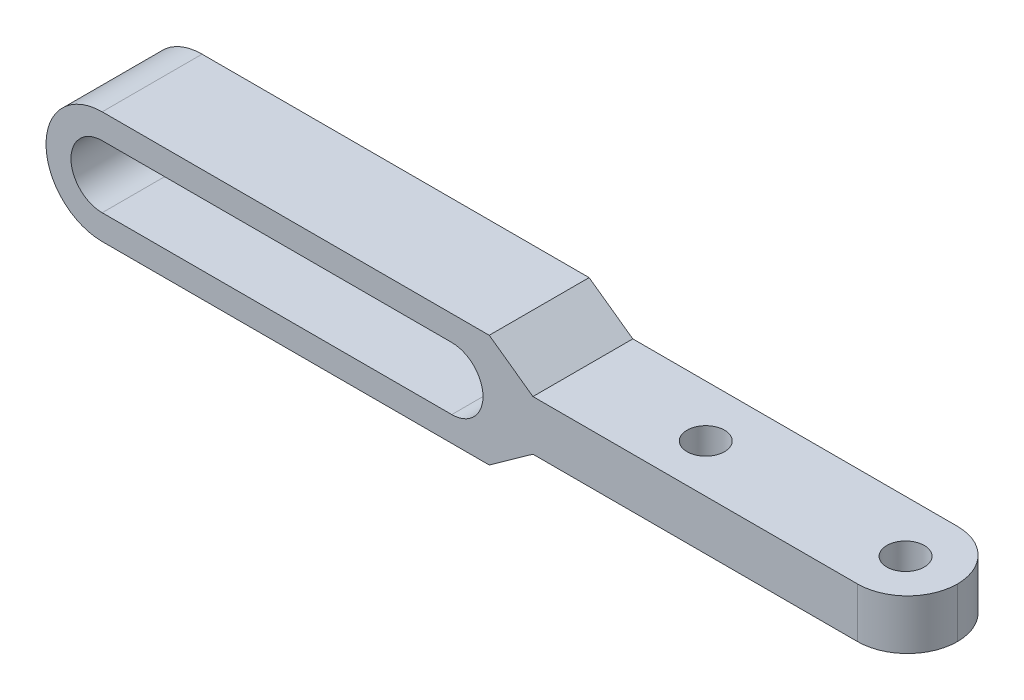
ISO-10303-21;
HEADER;
FILE_DESCRIPTION(('STEP AP214'),'2;1');
FILE_NAME('part.step','',(''),(''),'','','');
FILE_SCHEMA(('AUTOMOTIVE_DESIGN { 1 0 10303 214 1 1 1 1 }'));
ENDSEC;
DATA;
#1=APPLICATION_CONTEXT('core data for automotive mechanical design processes');
#2=APPLICATION_PROTOCOL_DEFINITION('international standard','automotive_design',2000,#1);
#3=PRODUCT_CONTEXT('',#1,'mechanical');
#4=PRODUCT('Part','Part','',(#3));
#5=PRODUCT_RELATED_PRODUCT_CATEGORY('part','',(#4));
#6=PRODUCT_DEFINITION_FORMATION('','',#4);
#7=PRODUCT_DEFINITION_CONTEXT('part definition',#1,'design');
#8=PRODUCT_DEFINITION('design','',#6,#7);
#9=PRODUCT_DEFINITION_SHAPE('','',#8);
#10=(LENGTH_UNIT() NAMED_UNIT(*) SI_UNIT(.MILLI.,.METRE.));
#11=(NAMED_UNIT(*) PLANE_ANGLE_UNIT() SI_UNIT($,.RADIAN.));
#12=(NAMED_UNIT(*) SI_UNIT($,.STERADIAN.) SOLID_ANGLE_UNIT());
#13=UNCERTAINTY_MEASURE_WITH_UNIT(LENGTH_MEASURE(1.E-05),#10,'distance_accuracy_value','');
#14=(GEOMETRIC_REPRESENTATION_CONTEXT(3) GLOBAL_UNCERTAINTY_ASSIGNED_CONTEXT((#13)) GLOBAL_UNIT_ASSIGNED_CONTEXT((#10,
#11,#12)) REPRESENTATION_CONTEXT('',''));
#15=CARTESIAN_POINT('',(0.,0.,0.));
#16=DIRECTION('',(0.,0.,1.));
#17=DIRECTION('',(1.,0.,0.));
#18=AXIS2_PLACEMENT_3D('',#15,#16,#17);
#19=CARTESIAN_POINT('',(0.,0.,16.));
#20=DIRECTION('',(-0.581238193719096,-0.813733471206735,0.));
#21=DIRECTION('',(0.813733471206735,-0.581238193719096,0.));
#22=AXIS2_PLACEMENT_3D('',#19,#20,#21);
#23=PLANE('',#22);
#24=DIRECTION('',(-0.813733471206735,0.581238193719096,0.));
#25=VECTOR('',#24,1.);
#26=CARTESIAN_POINT('',(0.,0.,0.));
#27=LINE('',#26,#25);
#28=CARTESIAN_POINT('',(0.,0.,0.));
#29=VERTEX_POINT('',#28);
#30=CARTESIAN_POINT('',(-7.,5.,0.));
#31=VERTEX_POINT('',#30);
#32=EDGE_CURVE('E201',#29,#31,#27,.T.);
#33=ORIENTED_EDGE('',*,*,#32,.T.);
#34=DIRECTION('',(0.,0.,-1.));
#35=VECTOR('',#34,1.);
#36=CARTESIAN_POINT('',(-7.,5.,16.));
#37=LINE('',#36,#35);
#38=CARTESIAN_POINT('',(-7.,5.,16.));
#39=VERTEX_POINT('',#38);
#40=EDGE_CURVE('E222',#39,#31,#37,.T.);
#41=ORIENTED_EDGE('',*,*,#40,.F.);
#42=DIRECTION('',(-0.813733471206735,0.581238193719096,0.));
#43=VECTOR('',#42,1.);
#44=CARTESIAN_POINT('',(0.,0.,16.));
#45=LINE('',#44,#43);
#46=CARTESIAN_POINT('',(0.,0.,16.));
#47=VERTEX_POINT('',#46);
#48=EDGE_CURVE('E184',#47,#39,#45,.T.);
#49=ORIENTED_EDGE('',*,*,#48,.F.);
#50=DIRECTION('',(0.,0.,-1.));
#51=VECTOR('',#50,1.);
#52=CARTESIAN_POINT('',(0.,0.,16.));
#53=LINE('',#52,#51);
#54=EDGE_CURVE('E200',#47,#29,#53,.T.);
#55=ORIENTED_EDGE('',*,*,#54,.T.);
#56=EDGE_LOOP('',(#33,#41,#49,#55));
#57=FACE_BOUND('',#56,.T.);
#58=ADVANCED_FACE('F33',(#57),#23,.F.);
#59=CARTESIAN_POINT('',(-7.,5.,16.));
#60=DIRECTION('',(0.,-1.,0.));
#61=DIRECTION('',(1.,0.,0.));
#62=AXIS2_PLACEMENT_3D('',#59,#60,#61);
#63=PLANE('',#62);
#64=DIRECTION('',(-1.,0.,0.));
#65=VECTOR('',#64,1.);
#66=CARTESIAN_POINT('',(-7.,5.,0.));
#67=LINE('',#66,#65);
#68=CARTESIAN_POINT('',(-69.,4.99999999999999,0.));
#69=VERTEX_POINT('',#68);
#70=EDGE_CURVE('E204',#31,#69,#67,.T.);
#71=ORIENTED_EDGE('',*,*,#70,.T.);
#72=DIRECTION('',(0.,0.,-1.));
#73=VECTOR('',#72,1.);
#74=CARTESIAN_POINT('',(-69.,4.99999999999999,16.));
#75=LINE('',#74,#73);
#76=CARTESIAN_POINT('',(-69.,4.99999999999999,16.));
#77=VERTEX_POINT('',#76);
#78=EDGE_CURVE('E11',#69,#77,#75,.F.);
#79=ORIENTED_EDGE('',*,*,#78,.T.);
#80=DIRECTION('',(-1.,0.,0.));
#81=VECTOR('',#80,1.);
#82=CARTESIAN_POINT('',(-7.,5.,16.));
#83=LINE('',#82,#81);
#84=EDGE_CURVE('E187',#39,#77,#83,.T.);
#85=ORIENTED_EDGE('',*,*,#84,.F.);
#86=ORIENTED_EDGE('',*,*,#40,.T.);
#87=EDGE_LOOP('',(#71,#79,#85,#86));
#88=FACE_BOUND('',#87,.T.);
#89=ADVANCED_FACE('F278',(#88),#63,.F.);
#90=CARTESIAN_POINT('',(-78.,-13.,16.));
#91=DIRECTION('',(0.,1.,0.));
#92=DIRECTION('',(-1.,0.,0.));
#93=AXIS2_PLACEMENT_3D('',#90,#91,#92);
#94=PLANE('',#93);
#95=DIRECTION('',(1.,0.,0.));
#96=VECTOR('',#95,1.);
#97=CARTESIAN_POINT('',(-78.,-13.,16.));
#98=LINE('',#97,#96);
#99=CARTESIAN_POINT('',(-69.,-13.,16.));
#100=VERTEX_POINT('',#99);
#101=CARTESIAN_POINT('',(-7.00000000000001,-13.,16.));
#102=VERTEX_POINT('',#101);
#103=EDGE_CURVE('E190',#100,#102,#98,.T.);
#104=ORIENTED_EDGE('',*,*,#103,.F.);
#105=DIRECTION('',(0.,0.,-1.));
#106=VECTOR('',#105,1.);
#107=CARTESIAN_POINT('',(-69.,-13.,16.));
#108=LINE('',#107,#106);
#109=CARTESIAN_POINT('',(-69.,-13.,0.));
#110=VERTEX_POINT('',#109);
#111=EDGE_CURVE('E242',#100,#110,#108,.T.);
#112=ORIENTED_EDGE('',*,*,#111,.T.);
#113=DIRECTION('',(1.,0.,0.));
#114=VECTOR('',#113,1.);
#115=CARTESIAN_POINT('',(-78.,-13.,0.));
#116=LINE('',#115,#114);
#117=CARTESIAN_POINT('',(-7.00000000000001,-13.,0.));
#118=VERTEX_POINT('',#117);
#119=EDGE_CURVE('E206',#110,#118,#116,.T.);
#120=ORIENTED_EDGE('',*,*,#119,.T.);
#121=DIRECTION('',(0.,0.,-1.));
#122=VECTOR('',#121,1.);
#123=CARTESIAN_POINT('',(-7.00000000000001,-13.,16.));
#124=LINE('',#123,#122);
#125=EDGE_CURVE('E219',#102,#118,#124,.T.);
#126=ORIENTED_EDGE('',*,*,#125,.F.);
#127=EDGE_LOOP('',(#104,#112,#120,#126));
#128=FACE_BOUND('',#127,.T.);
#129=ADVANCED_FACE('F259',(#128),#94,.F.);
#130=CARTESIAN_POINT('',(-7.00000000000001,-13.,16.));
#131=DIRECTION('',(-0.581238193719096,0.813733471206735,0.));
#132=DIRECTION('',(-0.813733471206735,-0.581238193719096,0.));
#133=AXIS2_PLACEMENT_3D('',#130,#131,#132);
#134=PLANE('',#133);
#135=DIRECTION('',(0.813733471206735,0.581238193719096,0.));
#136=VECTOR('',#135,1.);
#137=CARTESIAN_POINT('',(-7.00000000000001,-13.,0.));
#138=LINE('',#137,#136);
#139=CARTESIAN_POINT('',(0.,-7.99999999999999,0.));
#140=VERTEX_POINT('',#139);
#141=EDGE_CURVE('E208',#118,#140,#138,.T.);
#142=ORIENTED_EDGE('',*,*,#141,.T.);
#143=DIRECTION('',(0.,0.,-1.));
#144=VECTOR('',#143,1.);
#145=CARTESIAN_POINT('',(0.,-7.99999999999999,16.));
#146=LINE('',#145,#144);
#147=CARTESIAN_POINT('',(0.,-7.99999999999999,16.));
#148=VERTEX_POINT('',#147);
#149=EDGE_CURVE('E216',#148,#140,#146,.T.);
#150=ORIENTED_EDGE('',*,*,#149,.F.);
#151=DIRECTION('',(0.813733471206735,0.581238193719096,0.));
#152=VECTOR('',#151,1.);
#153=CARTESIAN_POINT('',(-7.00000000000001,-13.,16.));
#154=LINE('',#153,#152);
#155=EDGE_CURVE('E192',#102,#148,#154,.T.);
#156=ORIENTED_EDGE('',*,*,#155,.F.);
#157=ORIENTED_EDGE('',*,*,#125,.T.);
#158=EDGE_LOOP('',(#142,#150,#156,#157));
#159=FACE_BOUND('',#158,.T.);
#160=ADVANCED_FACE('F313',(#159),#134,.F.);
#161=CARTESIAN_POINT('',(60.,-7.99999999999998,16.));
#162=DIRECTION('',(0.,-1.,0.));
#163=DIRECTION('',(1.,0.,0.));
#164=AXIS2_PLACEMENT_3D('',#161,#162,#163);
#165=PLANE('',#164);
#166=CARTESIAN_POINT('',(52.,-7.99999999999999,8.31174647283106));
#167=DIRECTION('',(0.,-1.,0.));
#168=DIRECTION('',(0.,0.,-1.));
#169=AXIS2_PLACEMENT_3D('',#166,#167,#168);
#170=CIRCLE('',#169,3.);
#171=CARTESIAN_POINT('',(52.,-7.99999999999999,5.31174647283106));
#172=VERTEX_POINT('',#171);
#173=EDGE_CURVE('E173',#172,#172,#170,.T.);
#174=ORIENTED_EDGE('',*,*,#173,.F.);
#175=EDGE_LOOP('',(#174));
#176=FACE_BOUND('',#175,.T.);
#177=CARTESIAN_POINT('',(20.,-7.99999999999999,8.31174647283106));
#178=DIRECTION('',(0.,-1.,0.));
#179=DIRECTION('',(0.,0.,-1.));
#180=AXIS2_PLACEMENT_3D('',#177,#178,#179);
#181=CIRCLE('',#180,3.);
#182=CARTESIAN_POINT('',(20.,-7.99999999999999,5.31174647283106));
#183=VERTEX_POINT('',#182);
#184=EDGE_CURVE('E180',#183,#183,#181,.T.);
#185=ORIENTED_EDGE('',*,*,#184,.F.);
#186=EDGE_LOOP('',(#185));
#187=FACE_BOUND('',#186,.T.);
#188=DIRECTION('',(-1.,0.,0.));
#189=VECTOR('',#188,1.);
#190=CARTESIAN_POINT('',(60.,-7.99999999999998,0.));
#191=LINE('',#190,#189);
#192=CARTESIAN_POINT('',(52.,-7.99999999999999,0.));
#193=VERTEX_POINT('',#192);
#194=EDGE_CURVE('E211',#193,#140,#191,.T.);
#195=ORIENTED_EDGE('',*,*,#194,.F.);
#196=CARTESIAN_POINT('',(52.,-7.99999999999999,8.));
#197=DIRECTION('',(0.,-1.,0.));
#198=DIRECTION('',(1.,0.,0.));
#199=AXIS2_PLACEMENT_3D('',#196,#197,#198);
#200=CIRCLE('',#199,8.);
#201=CARTESIAN_POINT('',(60.,-7.99999999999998,8.));
#202=VERTEX_POINT('',#201);
#203=EDGE_CURVE('E234',#193,#202,#200,.T.);
#204=ORIENTED_EDGE('',*,*,#203,.T.);
#205=CARTESIAN_POINT('',(52.,-7.99999999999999,8.));
#206=DIRECTION('',(0.,-1.,0.));
#207=DIRECTION('',(1.,0.,0.));
#208=AXIS2_PLACEMENT_3D('',#205,#206,#207);
#209=CIRCLE('',#208,8.);
#210=CARTESIAN_POINT('',(52.,-7.99999999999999,16.));
#211=VERTEX_POINT('',#210);
#212=EDGE_CURVE('E232',#202,#211,#209,.T.);
#213=ORIENTED_EDGE('',*,*,#212,.T.);
#214=DIRECTION('',(-1.,0.,0.));
#215=VECTOR('',#214,1.);
#216=CARTESIAN_POINT('',(60.,-7.99999999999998,16.));
#217=LINE('',#216,#215);
#218=EDGE_CURVE('E195',#211,#148,#217,.T.);
#219=ORIENTED_EDGE('',*,*,#218,.T.);
#220=ORIENTED_EDGE('',*,*,#149,.T.);
#221=EDGE_LOOP('',(#195,#204,#213,#219,#220));
#222=FACE_BOUND('',#221,.T.);
#223=ADVANCED_FACE('F311',(#176,#187,#222),#165,.T.);
#224=CARTESIAN_POINT('',(0.,0.,16.));
#225=DIRECTION('',(0.,1.,0.));
#226=DIRECTION('',(-1.,0.,0.));
#227=AXIS2_PLACEMENT_3D('',#224,#225,#226);
#228=PLANE('',#227);
#229=CARTESIAN_POINT('',(52.,0.,8.31174647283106));
#230=DIRECTION('',(0.,1.,0.));
#231=DIRECTION('',(-1.,0.,0.));
#232=AXIS2_PLACEMENT_3D('',#229,#230,#231);
#233=CIRCLE('',#232,3.);
#234=CARTESIAN_POINT('',(49.,0.,8.31174647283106));
#235=VERTEX_POINT('',#234);
#236=EDGE_CURVE('E179',#235,#235,#233,.T.);
#237=ORIENTED_EDGE('',*,*,#236,.F.);
#238=EDGE_LOOP('',(#237));
#239=FACE_BOUND('',#238,.T.);
#240=CARTESIAN_POINT('',(20.,0.,8.31174647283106));
#241=DIRECTION('',(0.,1.,0.));
#242=DIRECTION('',(-1.,0.,0.));
#243=AXIS2_PLACEMENT_3D('',#240,#241,#242);
#244=CIRCLE('',#243,3.);
#245=CARTESIAN_POINT('',(17.,0.,8.31174647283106));
#246=VERTEX_POINT('',#245);
#247=EDGE_CURVE('E183',#246,#246,#244,.T.);
#248=ORIENTED_EDGE('',*,*,#247,.F.);
#249=EDGE_LOOP('',(#248));
#250=FACE_BOUND('',#249,.T.);
#251=CARTESIAN_POINT('',(52.,0.,8.));
#252=DIRECTION('',(0.,1.,0.));
#253=DIRECTION('',(-1.,0.,0.));
#254=AXIS2_PLACEMENT_3D('',#251,#252,#253);
#255=CIRCLE('',#254,8.);
#256=CARTESIAN_POINT('',(52.,0.,16.));
#257=VERTEX_POINT('',#256);
#258=CARTESIAN_POINT('',(60.,0.,8.));
#259=VERTEX_POINT('',#258);
#260=EDGE_CURVE('E236',#257,#259,#255,.T.);
#261=ORIENTED_EDGE('',*,*,#260,.T.);
#262=CARTESIAN_POINT('',(52.,0.,8.));
#263=DIRECTION('',(0.,1.,0.));
#264=DIRECTION('',(-1.,0.,0.));
#265=AXIS2_PLACEMENT_3D('',#262,#263,#264);
#266=CIRCLE('',#265,8.);
#267=CARTESIAN_POINT('',(52.,0.,0.));
#268=VERTEX_POINT('',#267);
#269=EDGE_CURVE('E238',#259,#268,#266,.T.);
#270=ORIENTED_EDGE('',*,*,#269,.T.);
#271=DIRECTION('',(1.,0.,0.));
#272=VECTOR('',#271,1.);
#273=CARTESIAN_POINT('',(0.,0.,0.));
#274=LINE('',#273,#272);
#275=EDGE_CURVE('E188',#29,#268,#274,.T.);
#276=ORIENTED_EDGE('',*,*,#275,.F.);
#277=ORIENTED_EDGE('',*,*,#54,.F.);
#278=DIRECTION('',(1.,0.,0.));
#279=VECTOR('',#278,1.);
#280=CARTESIAN_POINT('',(0.,0.,16.));
#281=LINE('',#280,#279);
#282=EDGE_CURVE('E197',#47,#257,#281,.T.);
#283=ORIENTED_EDGE('',*,*,#282,.T.);
#284=EDGE_LOOP('',(#261,#270,#276,#277,#283));
#285=FACE_BOUND('',#284,.T.);
#286=ADVANCED_FACE('F302',(#239,#250,#285),#228,.T.);
#287=CARTESIAN_POINT('',(0.,0.,16.));
#288=DIRECTION('',(0.,0.,-1.));
#289=DIRECTION('',(-1.,0.,0.));
#290=AXIS2_PLACEMENT_3D('',#287,#288,#289);
#291=PLANE('',#290);
#292=DIRECTION('',(1.,0.,0.));
#293=VECTOR('',#292,1.);
#294=CARTESIAN_POINT('',(-69.,-9.00000000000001,16.));
#295=LINE('',#294,#293);
#296=CARTESIAN_POINT('',(-69.,-9.00000000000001,16.));
#297=VERTEX_POINT('',#296);
#298=CARTESIAN_POINT('',(-13.,-9.,16.));
#299=VERTEX_POINT('',#298);
#300=EDGE_CURVE('E146',#297,#299,#295,.T.);
#301=ORIENTED_EDGE('',*,*,#300,.F.);
#302=CARTESIAN_POINT('',(-69.,-4.,16.));
#303=DIRECTION('',(0.,0.,-1.));
#304=DIRECTION('',(-1.,0.,0.));
#305=AXIS2_PLACEMENT_3D('',#302,#303,#304);
#306=CIRCLE('',#305,5.);
#307=CARTESIAN_POINT('',(-69.,0.999999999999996,16.));
#308=VERTEX_POINT('',#307);
#309=EDGE_CURVE('E138',#297,#308,#306,.T.);
#310=ORIENTED_EDGE('',*,*,#309,.T.);
#311=DIRECTION('',(1.,0.,0.));
#312=VECTOR('',#311,1.);
#313=CARTESIAN_POINT('',(-69.,0.999999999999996,16.));
#314=LINE('',#313,#312);
#315=CARTESIAN_POINT('',(-13.,0.999999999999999,16.));
#316=VERTEX_POINT('',#315);
#317=EDGE_CURVE('E150',#308,#316,#314,.T.);
#318=ORIENTED_EDGE('',*,*,#317,.T.);
#319=CARTESIAN_POINT('',(-13.,-4.,16.));
#320=DIRECTION('',(0.,0.,-1.));
#321=DIRECTION('',(-1.,0.,0.));
#322=AXIS2_PLACEMENT_3D('',#319,#320,#321);
#323=CIRCLE('',#322,5.);
#324=EDGE_CURVE('E154',#316,#299,#323,.T.);
#325=ORIENTED_EDGE('',*,*,#324,.T.);
#326=EDGE_LOOP('',(#301,#310,#318,#325));
#327=FACE_BOUND('',#326,.T.);
#328=CARTESIAN_POINT('',(-69.,-4.00000000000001,16.));
#329=DIRECTION('',(0.,0.,-1.));
#330=DIRECTION('',(-1.,0.,0.));
#331=AXIS2_PLACEMENT_3D('',#328,#329,#330);
#332=CIRCLE('',#331,9.);
#333=CARTESIAN_POINT('',(-78.,-4.00000000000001,16.));
#334=VERTEX_POINT('',#333);
#335=EDGE_CURVE('E49',#77,#334,#332,.F.);
#336=ORIENTED_EDGE('',*,*,#335,.T.);
#337=CARTESIAN_POINT('',(-69.,-4.00000000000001,16.));
#338=DIRECTION('',(0.,0.,-1.));
#339=DIRECTION('',(-1.,0.,0.));
#340=AXIS2_PLACEMENT_3D('',#337,#338,#339);
#341=CIRCLE('',#340,9.);
#342=EDGE_CURVE('E42',#334,#100,#341,.F.);
#343=ORIENTED_EDGE('',*,*,#342,.T.);
#344=ORIENTED_EDGE('',*,*,#103,.T.);
#345=ORIENTED_EDGE('',*,*,#155,.T.);
#346=ORIENTED_EDGE('',*,*,#218,.F.);
#347=DIRECTION('',(0.,-1.,0.));
#348=VECTOR('',#347,1.);
#349=CARTESIAN_POINT('',(52.,0.,16.));
#350=LINE('',#349,#348);
#351=EDGE_CURVE('E240',#211,#257,#350,.F.);
#352=ORIENTED_EDGE('',*,*,#351,.T.);
#353=ORIENTED_EDGE('',*,*,#282,.F.);
#354=ORIENTED_EDGE('',*,*,#48,.T.);
#355=ORIENTED_EDGE('',*,*,#84,.T.);
#356=EDGE_LOOP('',(#336,#343,#344,#345,#346,#352,#353,#354,#355));
#357=FACE_BOUND('',#356,.T.);
#358=ADVANCED_FACE('F156',(#327,#357),#291,.F.);
#359=CARTESIAN_POINT('',(0.,0.,0.));
#360=DIRECTION('',(0.,0.,-1.));
#361=DIRECTION('',(-1.,0.,0.));
#362=AXIS2_PLACEMENT_3D('',#359,#360,#361);
#363=PLANE('',#362);
#364=CARTESIAN_POINT('',(-69.,-4.,0.));
#365=DIRECTION('',(0.,0.,-1.));
#366=DIRECTION('',(-1.,0.,0.));
#367=AXIS2_PLACEMENT_3D('',#364,#365,#366);
#368=CIRCLE('',#367,5.);
#369=CARTESIAN_POINT('',(-69.,-9.00000000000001,0.));
#370=VERTEX_POINT('',#369);
#371=CARTESIAN_POINT('',(-69.,0.999999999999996,0.));
#372=VERTEX_POINT('',#371);
#373=EDGE_CURVE('E141',#370,#372,#368,.T.);
#374=ORIENTED_EDGE('',*,*,#373,.F.);
#375=DIRECTION('',(1.,0.,0.));
#376=VECTOR('',#375,1.);
#377=CARTESIAN_POINT('',(-69.,-9.00000000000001,0.));
#378=LINE('',#377,#376);
#379=CARTESIAN_POINT('',(-13.,-9.,0.));
#380=VERTEX_POINT('',#379);
#381=EDGE_CURVE('E157',#370,#380,#378,.T.);
#382=ORIENTED_EDGE('',*,*,#381,.T.);
#383=CARTESIAN_POINT('',(-13.,-4.,0.));
#384=DIRECTION('',(0.,0.,-1.));
#385=DIRECTION('',(-1.,0.,0.));
#386=AXIS2_PLACEMENT_3D('',#383,#384,#385);
#387=CIRCLE('',#386,5.);
#388=CARTESIAN_POINT('',(-13.,0.999999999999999,0.));
#389=VERTEX_POINT('',#388);
#390=EDGE_CURVE('E160',#389,#380,#387,.T.);
#391=ORIENTED_EDGE('',*,*,#390,.F.);
#392=DIRECTION('',(1.,0.,0.));
#393=VECTOR('',#392,1.);
#394=CARTESIAN_POINT('',(-69.,0.999999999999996,0.));
#395=LINE('',#394,#393);
#396=EDGE_CURVE('E166',#372,#389,#395,.T.);
#397=ORIENTED_EDGE('',*,*,#396,.F.);
#398=EDGE_LOOP('',(#374,#382,#391,#397));
#399=FACE_BOUND('',#398,.T.);
#400=ORIENTED_EDGE('',*,*,#119,.F.);
#401=CARTESIAN_POINT('',(-69.,-4.00000000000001,0.));
#402=DIRECTION('',(0.,0.,-1.));
#403=DIRECTION('',(-1.,0.,0.));
#404=AXIS2_PLACEMENT_3D('',#401,#402,#403);
#405=CIRCLE('',#404,9.);
#406=CARTESIAN_POINT('',(-78.,-4.00000000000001,0.));
#407=VERTEX_POINT('',#406);
#408=EDGE_CURVE('E249',#110,#407,#405,.T.);
#409=ORIENTED_EDGE('',*,*,#408,.T.);
#410=CARTESIAN_POINT('',(-69.,-4.00000000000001,0.));
#411=DIRECTION('',(0.,0.,-1.));
#412=DIRECTION('',(-1.,0.,0.));
#413=AXIS2_PLACEMENT_3D('',#410,#411,#412);
#414=CIRCLE('',#413,9.);
#415=EDGE_CURVE('E247',#407,#69,#414,.T.);
#416=ORIENTED_EDGE('',*,*,#415,.T.);
#417=ORIENTED_EDGE('',*,*,#70,.F.);
#418=ORIENTED_EDGE('',*,*,#32,.F.);
#419=ORIENTED_EDGE('',*,*,#275,.T.);
#420=DIRECTION('',(0.,-1.,0.));
#421=VECTOR('',#420,1.);
#422=CARTESIAN_POINT('',(52.,0.,0.));
#423=LINE('',#422,#421);
#424=EDGE_CURVE('E225',#268,#193,#423,.T.);
#425=ORIENTED_EDGE('',*,*,#424,.T.);
#426=ORIENTED_EDGE('',*,*,#194,.T.);
#427=ORIENTED_EDGE('',*,*,#141,.F.);
#428=EDGE_LOOP('',(#400,#409,#416,#417,#418,#419,#425,#426,#427));
#429=FACE_BOUND('',#428,.T.);
#430=ADVANCED_FACE('F265',(#399,#429),#363,.T.);
#431=CARTESIAN_POINT('',(20.,8.00000000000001,8.31174647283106));
#432=DIRECTION('',(0.,-1.,0.));
#433=DIRECTION('',(0.,0.,-1.));
#434=AXIS2_PLACEMENT_3D('',#431,#432,#433);
#435=CYLINDRICAL_SURFACE('',#434,3.);
#436=ORIENTED_EDGE('',*,*,#247,.T.);
#437=EDGE_LOOP('',(#436));
#438=FACE_BOUND('',#437,.T.);
#439=ORIENTED_EDGE('',*,*,#184,.T.);
#440=EDGE_LOOP('',(#439));
#441=FACE_BOUND('',#440,.T.);
#442=ADVANCED_FACE('F328',(#438,#441),#435,.F.);
#443=CARTESIAN_POINT('',(52.,8.00000000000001,8.31174647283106));
#444=DIRECTION('',(0.,-1.,0.));
#445=DIRECTION('',(0.,0.,-1.));
#446=AXIS2_PLACEMENT_3D('',#443,#444,#445);
#447=CYLINDRICAL_SURFACE('',#446,3.);
#448=ORIENTED_EDGE('',*,*,#236,.T.);
#449=EDGE_LOOP('',(#448));
#450=FACE_BOUND('',#449,.T.);
#451=ORIENTED_EDGE('',*,*,#173,.T.);
#452=EDGE_LOOP('',(#451));
#453=FACE_BOUND('',#452,.T.);
#454=ADVANCED_FACE('F334',(#450,#453),#447,.F.);
#455=CARTESIAN_POINT('',(-69.,-4.,16.));
#456=DIRECTION('',(0.,0.,-1.));
#457=DIRECTION('',(-1.,0.,0.));
#458=AXIS2_PLACEMENT_3D('',#455,#456,#457);
#459=CYLINDRICAL_SURFACE('',#458,5.);
#460=ORIENTED_EDGE('',*,*,#373,.T.);
#461=DIRECTION('',(0.,0.,-1.));
#462=VECTOR('',#461,1.);
#463=CARTESIAN_POINT('',(-69.,0.999999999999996,16.));
#464=LINE('',#463,#462);
#465=EDGE_CURVE('E134',#308,#372,#464,.T.);
#466=ORIENTED_EDGE('',*,*,#465,.F.);
#467=ORIENTED_EDGE('',*,*,#309,.F.);
#468=DIRECTION('',(0.,0.,-1.));
#469=VECTOR('',#468,1.);
#470=CARTESIAN_POINT('',(-69.,-9.00000000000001,16.));
#471=LINE('',#470,#469);
#472=EDGE_CURVE('E171',#297,#370,#471,.T.);
#473=ORIENTED_EDGE('',*,*,#472,.T.);
#474=EDGE_LOOP('',(#460,#466,#467,#473));
#475=FACE_BOUND('',#474,.T.);
#476=ADVANCED_FACE('F136',(#475),#459,.F.);
#477=CARTESIAN_POINT('',(-69.,-9.00000000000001,16.));
#478=DIRECTION('',(0.,1.,0.));
#479=DIRECTION('',(-1.,0.,0.));
#480=AXIS2_PLACEMENT_3D('',#477,#478,#479);
#481=PLANE('',#480);
#482=ORIENTED_EDGE('',*,*,#381,.F.);
#483=ORIENTED_EDGE('',*,*,#472,.F.);
#484=ORIENTED_EDGE('',*,*,#300,.T.);
#485=DIRECTION('',(0.,0.,-1.));
#486=VECTOR('',#485,1.);
#487=CARTESIAN_POINT('',(-13.,-9.,16.));
#488=LINE('',#487,#486);
#489=EDGE_CURVE('E174',#299,#380,#488,.T.);
#490=ORIENTED_EDGE('',*,*,#489,.T.);
#491=EDGE_LOOP('',(#482,#483,#484,#490));
#492=FACE_BOUND('',#491,.T.);
#493=ADVANCED_FACE('F340',(#492),#481,.T.);
#494=CARTESIAN_POINT('',(-13.,-4.,16.));
#495=DIRECTION('',(0.,0.,-1.));
#496=DIRECTION('',(-1.,0.,0.));
#497=AXIS2_PLACEMENT_3D('',#494,#495,#496);
#498=CYLINDRICAL_SURFACE('',#497,5.);
#499=ORIENTED_EDGE('',*,*,#390,.T.);
#500=ORIENTED_EDGE('',*,*,#489,.F.);
#501=ORIENTED_EDGE('',*,*,#324,.F.);
#502=DIRECTION('',(0.,0.,-1.));
#503=VECTOR('',#502,1.);
#504=CARTESIAN_POINT('',(-13.,0.999999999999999,16.));
#505=LINE('',#504,#503);
#506=EDGE_CURVE('E145',#316,#389,#505,.T.);
#507=ORIENTED_EDGE('',*,*,#506,.T.);
#508=EDGE_LOOP('',(#499,#500,#501,#507));
#509=FACE_BOUND('',#508,.T.);
#510=ADVANCED_FACE('F292',(#509),#498,.F.);
#511=CARTESIAN_POINT('',(-69.,0.999999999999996,16.));
#512=DIRECTION('',(0.,1.,0.));
#513=DIRECTION('',(-1.,0.,0.));
#514=AXIS2_PLACEMENT_3D('',#511,#512,#513);
#515=PLANE('',#514);
#516=ORIENTED_EDGE('',*,*,#396,.T.);
#517=ORIENTED_EDGE('',*,*,#506,.F.);
#518=ORIENTED_EDGE('',*,*,#317,.F.);
#519=ORIENTED_EDGE('',*,*,#465,.T.);
#520=EDGE_LOOP('',(#516,#517,#518,#519));
#521=FACE_BOUND('',#520,.T.);
#522=ADVANCED_FACE('F151',(#521),#515,.F.);
#523=CARTESIAN_POINT('',(52.,0.,8.));
#524=DIRECTION('',(0.,1.,0.));
#525=DIRECTION('',(0.,0.,1.));
#526=AXIS2_PLACEMENT_3D('',#523,#524,#525);
#527=CYLINDRICAL_SURFACE('',#526,8.);
#528=DIRECTION('',(0.,-1.,0.));
#529=VECTOR('',#528,1.);
#530=CARTESIAN_POINT('',(60.,-7.99999999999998,8.));
#531=LINE('',#530,#529);
#532=EDGE_CURVE('E167',#259,#202,#531,.T.);
#533=ORIENTED_EDGE('',*,*,#532,.F.);
#534=ORIENTED_EDGE('',*,*,#260,.F.);
#535=ORIENTED_EDGE('',*,*,#351,.F.);
#536=ORIENTED_EDGE('',*,*,#212,.F.);
#537=EDGE_LOOP('',(#533,#534,#535,#536));
#538=FACE_BOUND('',#537,.T.);
#539=ADVANCED_FACE('F274',(#538),#527,.T.);
#540=CARTESIAN_POINT('',(52.,0.,8.));
#541=DIRECTION('',(0.,-1.,0.));
#542=DIRECTION('',(0.,0.,-1.));
#543=AXIS2_PLACEMENT_3D('',#540,#541,#542);
#544=CYLINDRICAL_SURFACE('',#543,8.);
#545=ORIENTED_EDGE('',*,*,#269,.F.);
#546=ORIENTED_EDGE('',*,*,#532,.T.);
#547=ORIENTED_EDGE('',*,*,#203,.F.);
#548=ORIENTED_EDGE('',*,*,#424,.F.);
#549=EDGE_LOOP('',(#545,#546,#547,#548));
#550=FACE_BOUND('',#549,.T.);
#551=ADVANCED_FACE('F269',(#550),#544,.T.);
#552=CARTESIAN_POINT('',(-69.,-4.00000000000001,16.));
#553=DIRECTION('',(0.,0.,-1.));
#554=DIRECTION('',(-1.,0.,0.));
#555=AXIS2_PLACEMENT_3D('',#552,#553,#554);
#556=CYLINDRICAL_SURFACE('',#555,9.);
#557=DIRECTION('',(0.,0.,-1.));
#558=VECTOR('',#557,1.);
#559=CARTESIAN_POINT('',(-78.,-4.00000000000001,16.));
#560=LINE('',#559,#558);
#561=EDGE_CURVE('E37',#334,#407,#560,.T.);
#562=ORIENTED_EDGE('',*,*,#561,.F.);
#563=ORIENTED_EDGE('',*,*,#335,.F.);
#564=ORIENTED_EDGE('',*,*,#78,.F.);
#565=ORIENTED_EDGE('',*,*,#415,.F.);
#566=EDGE_LOOP('',(#562,#563,#564,#565));
#567=FACE_BOUND('',#566,.T.);
#568=ADVANCED_FACE('F35',(#567),#556,.T.);
#569=CARTESIAN_POINT('',(-69.,-4.00000000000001,16.));
#570=DIRECTION('',(0.,0.,-1.));
#571=DIRECTION('',(-1.,0.,0.));
#572=AXIS2_PLACEMENT_3D('',#569,#570,#571);
#573=CYLINDRICAL_SURFACE('',#572,9.);
#574=ORIENTED_EDGE('',*,*,#342,.F.);
#575=ORIENTED_EDGE('',*,*,#561,.T.);
#576=ORIENTED_EDGE('',*,*,#408,.F.);
#577=ORIENTED_EDGE('',*,*,#111,.F.);
#578=EDGE_LOOP('',(#574,#575,#576,#577));
#579=FACE_BOUND('',#578,.T.);
#580=ADVANCED_FACE('F262',(#579),#573,.T.);
#581=CLOSED_SHELL('',(#58,#89,#129,#160,#223,#286,#358,#430,#442,#454,#476,#493,#510,#522,#539,
#551,#568,#580));
#582=MANIFOLD_SOLID_BREP('B2',#581);
#583=ADVANCED_BREP_SHAPE_REPRESENTATION('',(#18,#582),#14);
#584=SHAPE_DEFINITION_REPRESENTATION(#9,#583);
ENDSEC;
END-ISO-10303-21;
